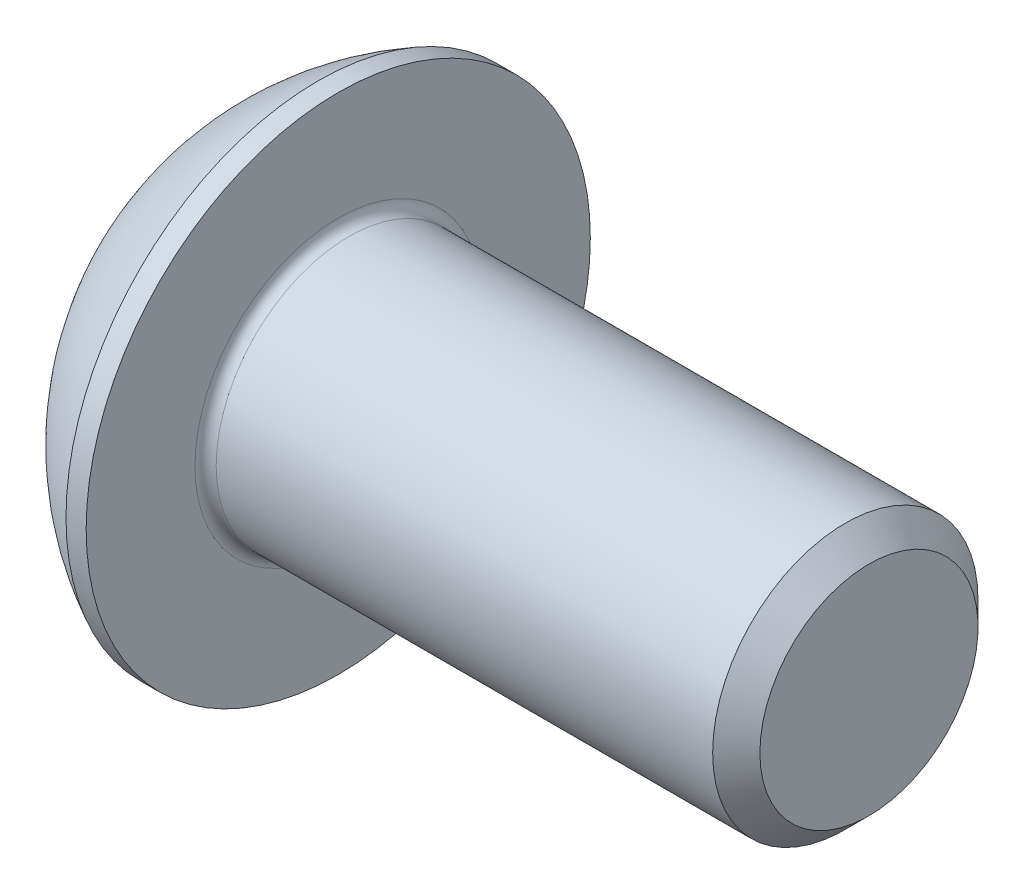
from build123d import *

# Parameters (mm, degrees)
FILLET1_R   = 0.2
HEX_2_DEPTH = 1.56


with BuildPart() as part:
    # BodySke → BaseBody (revolve)
    with BuildSketch(Plane.XY, mode=Mode.PRIVATE) as basebody_sk:
        with BuildLine():
            Line((12.75, 0), (12.75, 2.055))
            Line((12.75, 2.055), (12.305, 2.5))
            Line((12.305, 2.5), (2.75, 2.5))
            Line((2.75, 2.5), (2.75, 4.75))
            Line((2.75, 4.75), (2.37, 4.75))
            ThreePointArc((2.37, 4.75), (0.992680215, 3.754414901), (0, 2.375))
            Line((0, 2.375), (0, 0))
            Line((0, 0), (12.75, 0))
        make_face()
    revolve(basebody_sk.sketch.rotate(Axis((0, 0, 0), (1, 0, 0)), 90), axis=Axis((0, 0, 0), (1, 0, 0)))

    # Fillet1
    fillet1_edges = [part.edges().sort_by_distance(p)[0] for p in [
        (2.75, 0, -2.5),
    ]]
    fillet(fillet1_edges, radius=FILLET1_R)

    # Sketch2 → PreBroach (revolve, cut)
    with BuildSketch(Plane.XY, mode=Mode.PRIVATE) as prebroach_sk:
        Polygon((0, 1.5), (1.56, 1.5), (2.426025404, 0), (0, 0), align=None)
    revolve(prebroach_sk.sketch.rotate(Axis((0, 0, 0), (1, 0, 0)), 90), axis=Axis((0, 0, 0), (1, 0, 0)), mode=Mode.SUBTRACT)

    # Sketch3 → Hex 2 (cut)
    with BuildSketch(Plane(origin=(0, 0, 0), x_dir=(0, 0, -1), z_dir=(1, 0, 0))):
        Polygon((-1.5, -0.866025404), (-1.5, 0.866025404), (0, 1.732050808), (1.5, 0.866025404), (1.5, -0.866025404), (0, -1.732050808), align=None)
    extrude(amount=HEX_2_DEPTH, mode=Mode.SUBTRACT)


solid = part.part
